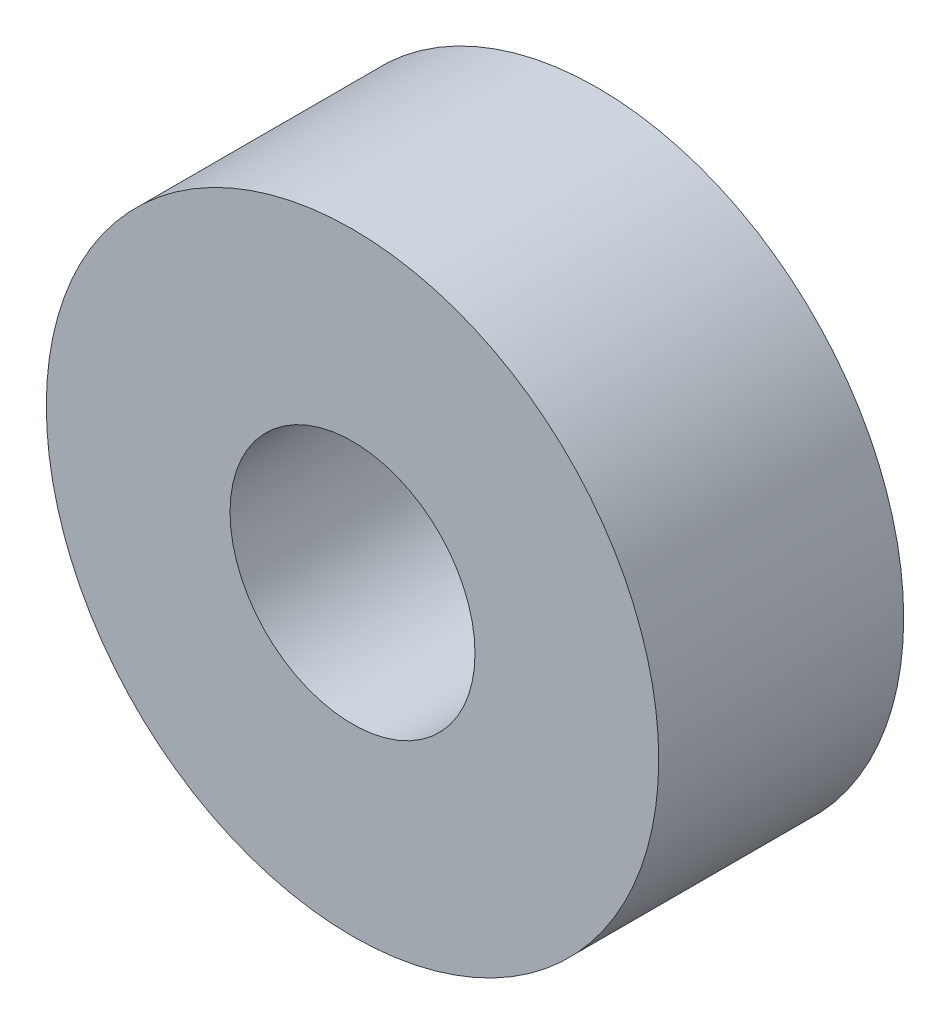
from build123d import *

# Parameters (mm, degrees)
SKIZZE1_R               = 25
SKIZZE1_R_2             = 10
LINEAR_AUSTRAGEN1_DEPTH = 20


with BuildPart() as part:
    # Skizze1 → Linear austragen1 (new body)
    with BuildSketch(Plane.XY):
        Circle(SKIZZE1_R)
        Circle(SKIZZE1_R_2, mode=Mode.SUBTRACT)
    extrude(amount=LINEAR_AUSTRAGEN1_DEPTH)


solid = part.part
